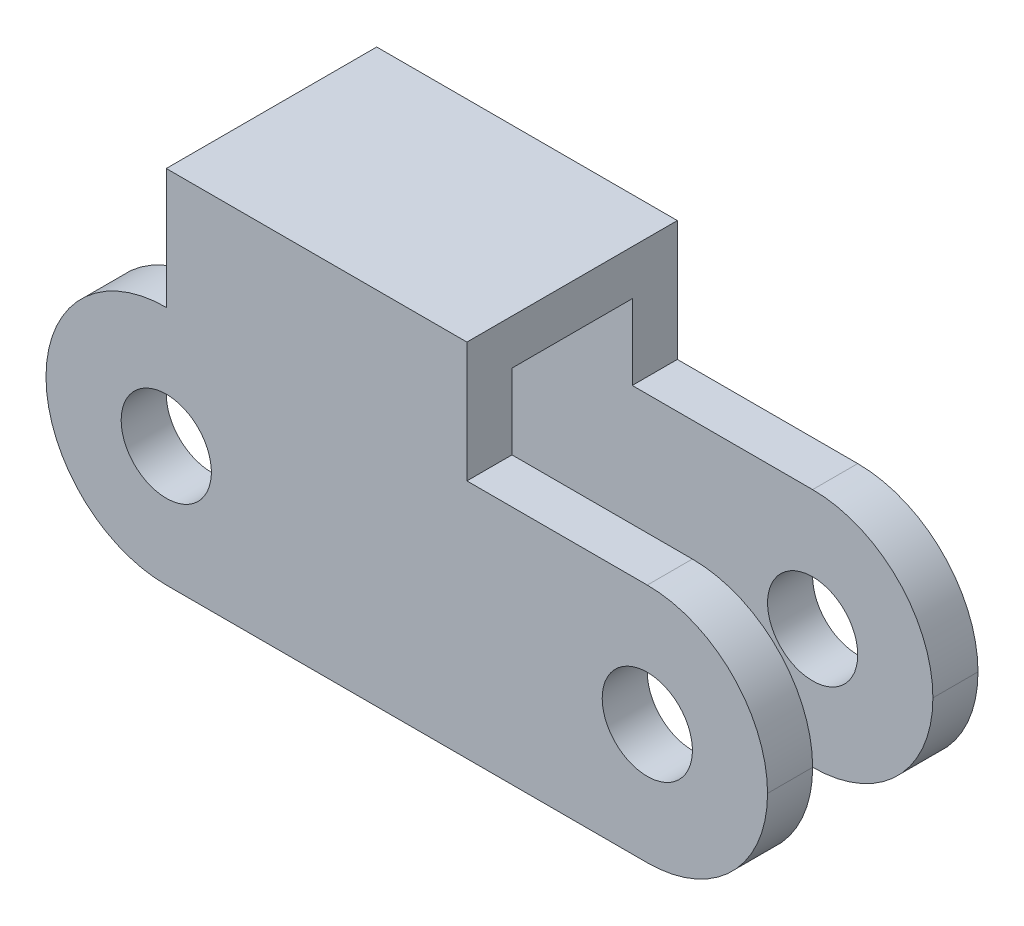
ISO-10303-21;
HEADER;
FILE_DESCRIPTION(('STEP AP214'),'2;1');
FILE_NAME('part.step','',(''),(''),'','','');
FILE_SCHEMA(('AUTOMOTIVE_DESIGN { 1 0 10303 214 1 1 1 1 }'));
ENDSEC;
DATA;
#1=APPLICATION_CONTEXT('core data for automotive mechanical design processes');
#2=APPLICATION_PROTOCOL_DEFINITION('international standard','automotive_design',2000,#1);
#3=PRODUCT_CONTEXT('',#1,'mechanical');
#4=PRODUCT('Part','Part','',(#3));
#5=PRODUCT_RELATED_PRODUCT_CATEGORY('part','',(#4));
#6=PRODUCT_DEFINITION_FORMATION('','',#4);
#7=PRODUCT_DEFINITION_CONTEXT('part definition',#1,'design');
#8=PRODUCT_DEFINITION('design','',#6,#7);
#9=PRODUCT_DEFINITION_SHAPE('','',#8);
#10=(LENGTH_UNIT() NAMED_UNIT(*) SI_UNIT(.MILLI.,.METRE.));
#11=(NAMED_UNIT(*) PLANE_ANGLE_UNIT() SI_UNIT($,.RADIAN.));
#12=(NAMED_UNIT(*) SI_UNIT($,.STERADIAN.) SOLID_ANGLE_UNIT());
#13=UNCERTAINTY_MEASURE_WITH_UNIT(LENGTH_MEASURE(1.E-05),#10,'distance_accuracy_value','');
#14=(GEOMETRIC_REPRESENTATION_CONTEXT(3) GLOBAL_UNCERTAINTY_ASSIGNED_CONTEXT((#13)) GLOBAL_UNIT_ASSIGNED_CONTEXT((#10,
#11,#12)) REPRESENTATION_CONTEXT('',''));
#15=CARTESIAN_POINT('',(0.,0.,0.));
#16=DIRECTION('',(0.,0.,1.));
#17=DIRECTION('',(1.,0.,0.));
#18=AXIS2_PLACEMENT_3D('',#15,#16,#17);
#19=CARTESIAN_POINT('',(0.,0.,0.));
#20=DIRECTION('',(0.,0.,-1.));
#21=DIRECTION('',(-1.,0.,0.));
#22=AXIS2_PLACEMENT_3D('',#19,#20,#21);
#23=PLANE('',#22);
#24=CARTESIAN_POINT('',(-22.7894430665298,4.49999999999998,0.));
#25=DIRECTION('',(0.,0.,-1.));
#26=DIRECTION('',(-1.,0.,0.));
#27=AXIS2_PLACEMENT_3D('',#24,#25,#26);
#28=CIRCLE('',#27,3.);
#29=CARTESIAN_POINT('',(-25.7894430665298,4.49999999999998,0.));
#30=VERTEX_POINT('',#29);
#31=EDGE_CURVE('E354',#30,#30,#28,.T.);
#32=ORIENTED_EDGE('',*,*,#31,.F.);
#33=EDGE_LOOP('',(#32));
#34=FACE_BOUND('',#33,.T.);
#35=CARTESIAN_POINT('',(9.21055693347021,4.4778667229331,0.));
#36=DIRECTION('',(0.,0.,-1.));
#37=DIRECTION('',(-1.,0.,0.));
#38=AXIS2_PLACEMENT_3D('',#35,#36,#37);
#39=CIRCLE('',#38,3.);
#40=CARTESIAN_POINT('',(6.2105569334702,4.4778667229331,0.));
#41=VERTEX_POINT('',#40);
#42=EDGE_CURVE('E316',#41,#41,#39,.T.);
#43=ORIENTED_EDGE('',*,*,#42,.F.);
#44=EDGE_LOOP('',(#43));
#45=FACE_BOUND('',#44,.T.);
#46=DIRECTION('',(1.,0.,0.));
#47=VECTOR('',#46,1.);
#48=CARTESIAN_POINT('',(17.2105263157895,-3.50000000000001,0.));
#49=LINE('',#48,#47);
#50=CARTESIAN_POINT('',(-22.7894736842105,-3.50000000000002,0.));
#51=VERTEX_POINT('',#50);
#52=CARTESIAN_POINT('',(9.21052631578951,-3.50000000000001,0.));
#53=VERTEX_POINT('',#52);
#54=EDGE_CURVE('E202',#51,#53,#49,.T.);
#55=ORIENTED_EDGE('',*,*,#54,.F.);
#56=CARTESIAN_POINT('',(-22.7894736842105,4.49999999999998,0.));
#57=DIRECTION('',(0.,0.,-1.));
#58=DIRECTION('',(-1.,0.,0.));
#59=AXIS2_PLACEMENT_3D('',#56,#57,#58);
#60=CIRCLE('',#59,8.);
#61=CARTESIAN_POINT('',(-30.7894736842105,4.49999999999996,0.));
#62=VERTEX_POINT('',#61);
#63=EDGE_CURVE('E256',#51,#62,#60,.T.);
#64=ORIENTED_EDGE('',*,*,#63,.T.);
#65=CARTESIAN_POINT('',(-22.7894736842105,4.49999999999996,0.));
#66=DIRECTION('',(0.,0.,-1.));
#67=DIRECTION('',(-1.,0.,0.));
#68=AXIS2_PLACEMENT_3D('',#65,#66,#67);
#69=CIRCLE('',#68,8.);
#70=CARTESIAN_POINT('',(-22.7894736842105,12.5,0.));
#71=VERTEX_POINT('',#70);
#72=EDGE_CURVE('E254',#62,#71,#69,.T.);
#73=ORIENTED_EDGE('',*,*,#72,.T.);
#74=DIRECTION('',(0.,-1.,0.));
#75=VECTOR('',#74,1.);
#76=CARTESIAN_POINT('',(-22.7894736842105,12.5,0.));
#77=LINE('',#76,#75);
#78=CARTESIAN_POINT('',(-22.7894736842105,17.5,0.));
#79=VERTEX_POINT('',#78);
#80=EDGE_CURVE('E207',#79,#71,#77,.T.);
#81=ORIENTED_EDGE('',*,*,#80,.F.);
#82=DIRECTION('',(1.,0.,0.));
#83=VECTOR('',#82,1.);
#84=CARTESIAN_POINT('',(0.,17.5,0.));
#85=LINE('',#84,#83);
#86=CARTESIAN_POINT('',(-2.7894736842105,17.5,0.));
#87=VERTEX_POINT('',#86);
#88=EDGE_CURVE('E167',#79,#87,#85,.T.);
#89=ORIENTED_EDGE('',*,*,#88,.T.);
#90=DIRECTION('',(0.,1.,0.));
#91=VECTOR('',#90,1.);
#92=CARTESIAN_POINT('',(-2.7894736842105,20.5,0.));
#93=LINE('',#92,#91);
#94=CARTESIAN_POINT('',(-2.7894736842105,12.5,0.));
#95=VERTEX_POINT('',#94);
#96=EDGE_CURVE('E220',#95,#87,#93,.T.);
#97=ORIENTED_EDGE('',*,*,#96,.F.);
#98=DIRECTION('',(-1.,0.,0.));
#99=VECTOR('',#98,1.);
#100=CARTESIAN_POINT('',(-2.7894736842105,12.5,0.));
#101=LINE('',#100,#99);
#102=CARTESIAN_POINT('',(9.21052631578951,12.5,0.));
#103=VERTEX_POINT('',#102);
#104=EDGE_CURVE('E218',#103,#95,#101,.T.);
#105=ORIENTED_EDGE('',*,*,#104,.F.);
#106=CARTESIAN_POINT('',(9.21052631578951,4.49999999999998,0.));
#107=DIRECTION('',(0.,0.,-1.));
#108=DIRECTION('',(-1.,0.,0.));
#109=AXIS2_PLACEMENT_3D('',#106,#107,#108);
#110=CIRCLE('',#109,8.);
#111=CARTESIAN_POINT('',(17.2105263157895,4.49999999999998,0.));
#112=VERTEX_POINT('',#111);
#113=EDGE_CURVE('E250',#103,#112,#110,.T.);
#114=ORIENTED_EDGE('',*,*,#113,.T.);
#115=CARTESIAN_POINT('',(9.21052631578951,4.49999999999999,0.));
#116=DIRECTION('',(0.,0.,-1.));
#117=DIRECTION('',(-1.,0.,0.));
#118=AXIS2_PLACEMENT_3D('',#115,#116,#117);
#119=CIRCLE('',#118,8.);
#120=EDGE_CURVE('E252',#112,#53,#119,.T.);
#121=ORIENTED_EDGE('',*,*,#120,.T.);
#122=EDGE_LOOP('',(#55,#64,#73,#81,#89,#97,#105,#114,#121));
#123=FACE_BOUND('',#122,.T.);
#124=ADVANCED_FACE('F35',(#34,#45,#123),#23,.T.);
#125=CARTESIAN_POINT('',(17.2105263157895,-3.50000000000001,3.));
#126=DIRECTION('',(0.,1.,0.));
#127=DIRECTION('',(-1.,0.,0.));
#128=AXIS2_PLACEMENT_3D('',#125,#126,#127);
#129=PLANE('',#128);
#130=DIRECTION('',(1.,0.,0.));
#131=VECTOR('',#130,1.);
#132=CARTESIAN_POINT('',(17.2105263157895,-3.50000000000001,3.));
#133=LINE('',#132,#131);
#134=CARTESIAN_POINT('',(-22.7894736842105,-3.50000000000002,3.));
#135=VERTEX_POINT('',#134);
#136=CARTESIAN_POINT('',(9.21052631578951,-3.50000000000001,3.));
#137=VERTEX_POINT('',#136);
#138=EDGE_CURVE('E203',#135,#137,#133,.T.);
#139=ORIENTED_EDGE('',*,*,#138,.F.);
#140=DIRECTION('',(0.,0.,-1.));
#141=VECTOR('',#140,1.);
#142=CARTESIAN_POINT('',(-22.7894736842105,-3.50000000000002,3.));
#143=LINE('',#142,#141);
#144=EDGE_CURVE('E247',#135,#51,#143,.T.);
#145=ORIENTED_EDGE('',*,*,#144,.T.);
#146=ORIENTED_EDGE('',*,*,#54,.T.);
#147=DIRECTION('',(0.,0.,-1.));
#148=VECTOR('',#147,1.);
#149=CARTESIAN_POINT('',(9.21052631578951,-3.50000000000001,3.));
#150=LINE('',#149,#148);
#151=EDGE_CURVE('E234',#53,#137,#150,.F.);
#152=ORIENTED_EDGE('',*,*,#151,.T.);
#153=EDGE_LOOP('',(#139,#145,#146,#152));
#154=FACE_BOUND('',#153,.T.);
#155=ADVANCED_FACE('F379',(#154),#129,.F.);
#156=CARTESIAN_POINT('',(-2.7894736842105,12.5,3.));
#157=DIRECTION('',(0.,-1.,0.));
#158=DIRECTION('',(0.,0.,-1.));
#159=AXIS2_PLACEMENT_3D('',#156,#157,#158);
#160=PLANE('',#159);
#161=DIRECTION('',(-1.,0.,0.));
#162=VECTOR('',#161,1.);
#163=CARTESIAN_POINT('',(-2.7894736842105,12.5,3.));
#164=LINE('',#163,#162);
#165=CARTESIAN_POINT('',(9.21052631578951,12.5,3.));
#166=VERTEX_POINT('',#165);
#167=CARTESIAN_POINT('',(-2.7894736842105,12.5,3.));
#168=VERTEX_POINT('',#167);
#169=EDGE_CURVE('E206',#166,#168,#164,.T.);
#170=ORIENTED_EDGE('',*,*,#169,.F.);
#171=DIRECTION('',(0.,0.,-1.));
#172=VECTOR('',#171,1.);
#173=CARTESIAN_POINT('',(9.21052631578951,12.5,3.));
#174=LINE('',#173,#172);
#175=EDGE_CURVE('E266',#166,#103,#174,.T.);
#176=ORIENTED_EDGE('',*,*,#175,.T.);
#177=ORIENTED_EDGE('',*,*,#104,.T.);
#178=DIRECTION('',(0.,0.,-1.));
#179=VECTOR('',#178,1.);
#180=CARTESIAN_POINT('',(-2.7894736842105,12.5,3.));
#181=LINE('',#180,#179);
#182=EDGE_CURVE('E230',#168,#95,#181,.T.);
#183=ORIENTED_EDGE('',*,*,#182,.F.);
#184=EDGE_LOOP('',(#170,#176,#177,#183));
#185=FACE_BOUND('',#184,.T.);
#186=ADVANCED_FACE('F385',(#185),#160,.F.);
#187=CARTESIAN_POINT('',(-2.7894736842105,20.5,3.));
#188=DIRECTION('',(-1.,0.,0.));
#189=DIRECTION('',(0.,-1.,0.));
#190=AXIS2_PLACEMENT_3D('',#187,#188,#189);
#191=PLANE('',#190);
#192=DIRECTION('',(0.,0.,-1.));
#193=VECTOR('',#192,1.);
#194=CARTESIAN_POINT('',(-2.7894736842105,20.5,3.));
#195=LINE('',#194,#193);
#196=CARTESIAN_POINT('',(-2.7894736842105,20.5,3.));
#197=VERTEX_POINT('',#196);
#198=CARTESIAN_POINT('',(-2.7894736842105,20.5,-11.));
#199=VERTEX_POINT('',#198);
#200=EDGE_CURVE('E228',#197,#199,#195,.T.);
#201=ORIENTED_EDGE('',*,*,#200,.F.);
#202=DIRECTION('',(0.,1.,0.));
#203=VECTOR('',#202,1.);
#204=CARTESIAN_POINT('',(-2.7894736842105,20.5,3.));
#205=LINE('',#204,#203);
#206=EDGE_CURVE('E209',#168,#197,#205,.T.);
#207=ORIENTED_EDGE('',*,*,#206,.F.);
#208=ORIENTED_EDGE('',*,*,#182,.T.);
#209=ORIENTED_EDGE('',*,*,#96,.T.);
#210=DIRECTION('',(0.,0.,-1.));
#211=VECTOR('',#210,1.);
#212=CARTESIAN_POINT('',(-2.7894736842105,17.5,0.));
#213=LINE('',#212,#211);
#214=CARTESIAN_POINT('',(-2.7894736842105,17.5,-8.));
#215=VERTEX_POINT('',#214);
#216=EDGE_CURVE('E172',#87,#215,#213,.T.);
#217=ORIENTED_EDGE('',*,*,#216,.T.);
#218=DIRECTION('',(0.,1.,0.));
#219=VECTOR('',#218,1.);
#220=CARTESIAN_POINT('',(-2.7894736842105,20.5,-8.));
#221=LINE('',#220,#219);
#222=CARTESIAN_POINT('',(-2.7894736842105,12.5,-8.));
#223=VERTEX_POINT('',#222);
#224=EDGE_CURVE('E181',#223,#215,#221,.T.);
#225=ORIENTED_EDGE('',*,*,#224,.F.);
#226=DIRECTION('',(0.,0.,1.));
#227=VECTOR('',#226,1.);
#228=CARTESIAN_POINT('',(-2.7894736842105,12.5,-11.));
#229=LINE('',#228,#227);
#230=CARTESIAN_POINT('',(-2.7894736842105,12.5,-11.));
#231=VERTEX_POINT('',#230);
#232=EDGE_CURVE('E182',#231,#223,#229,.T.);
#233=ORIENTED_EDGE('',*,*,#232,.F.);
#234=DIRECTION('',(0.,1.,0.));
#235=VECTOR('',#234,1.);
#236=CARTESIAN_POINT('',(-2.7894736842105,20.5,-11.));
#237=LINE('',#236,#235);
#238=EDGE_CURVE('E311',#231,#199,#237,.T.);
#239=ORIENTED_EDGE('',*,*,#238,.T.);
#240=EDGE_LOOP('',(#201,#207,#208,#209,#217,#225,#233,#239));
#241=FACE_BOUND('',#240,.T.);
#242=ADVANCED_FACE('F327',(#241),#191,.F.);
#243=CARTESIAN_POINT('',(-22.7894736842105,20.5,3.));
#244=DIRECTION('',(0.,-1.,0.));
#245=DIRECTION('',(1.,0.,0.));
#246=AXIS2_PLACEMENT_3D('',#243,#244,#245);
#247=PLANE('',#246);
#248=ORIENTED_EDGE('',*,*,#200,.T.);
#249=DIRECTION('',(-1.,0.,0.));
#250=VECTOR('',#249,1.);
#251=CARTESIAN_POINT('',(-22.7894736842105,20.5,-11.));
#252=LINE('',#251,#250);
#253=CARTESIAN_POINT('',(-22.7894736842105,20.5,-11.));
#254=VERTEX_POINT('',#253);
#255=EDGE_CURVE('E309',#199,#254,#252,.T.);
#256=ORIENTED_EDGE('',*,*,#255,.T.);
#257=DIRECTION('',(0.,0.,-1.));
#258=VECTOR('',#257,1.);
#259=CARTESIAN_POINT('',(-22.7894736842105,20.5,3.));
#260=LINE('',#259,#258);
#261=CARTESIAN_POINT('',(-22.7894736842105,20.5,3.));
#262=VERTEX_POINT('',#261);
#263=EDGE_CURVE('E226',#262,#254,#260,.T.);
#264=ORIENTED_EDGE('',*,*,#263,.F.);
#265=DIRECTION('',(-1.,0.,0.));
#266=VECTOR('',#265,1.);
#267=CARTESIAN_POINT('',(-22.7894736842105,20.5,3.));
#268=LINE('',#267,#266);
#269=EDGE_CURVE('E211',#197,#262,#268,.T.);
#270=ORIENTED_EDGE('',*,*,#269,.F.);
#271=EDGE_LOOP('',(#248,#256,#264,#270));
#272=FACE_BOUND('',#271,.T.);
#273=ADVANCED_FACE('F345',(#272),#247,.F.);
#274=CARTESIAN_POINT('',(-22.7894736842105,12.5,3.));
#275=DIRECTION('',(1.,0.,0.));
#276=DIRECTION('',(0.,1.,0.));
#277=AXIS2_PLACEMENT_3D('',#274,#275,#276);
#278=PLANE('',#277);
#279=ORIENTED_EDGE('',*,*,#263,.T.);
#280=DIRECTION('',(0.,-1.,0.));
#281=VECTOR('',#280,1.);
#282=CARTESIAN_POINT('',(-22.7894736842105,12.5,-11.));
#283=LINE('',#282,#281);
#284=CARTESIAN_POINT('',(-22.7894736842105,12.5,-11.));
#285=VERTEX_POINT('',#284);
#286=EDGE_CURVE('E198',#254,#285,#283,.T.);
#287=ORIENTED_EDGE('',*,*,#286,.T.);
#288=DIRECTION('',(0.,0.,1.));
#289=VECTOR('',#288,1.);
#290=CARTESIAN_POINT('',(-22.7894736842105,12.5,-11.));
#291=LINE('',#290,#289);
#292=CARTESIAN_POINT('',(-22.7894736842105,12.5,-7.99999999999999));
#293=VERTEX_POINT('',#292);
#294=EDGE_CURVE('E187',#285,#293,#291,.T.);
#295=ORIENTED_EDGE('',*,*,#294,.T.);
#296=DIRECTION('',(0.,-1.,0.));
#297=VECTOR('',#296,1.);
#298=CARTESIAN_POINT('',(-22.7894736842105,12.5,-7.99999999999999));
#299=LINE('',#298,#297);
#300=CARTESIAN_POINT('',(-22.7894736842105,17.5,-7.99999999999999));
#301=VERTEX_POINT('',#300);
#302=EDGE_CURVE('E178',#301,#293,#299,.T.);
#303=ORIENTED_EDGE('',*,*,#302,.F.);
#304=DIRECTION('',(0.,0.,-1.));
#305=VECTOR('',#304,1.);
#306=CARTESIAN_POINT('',(-22.7894736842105,17.5,0.));
#307=LINE('',#306,#305);
#308=EDGE_CURVE('E161',#79,#301,#307,.T.);
#309=ORIENTED_EDGE('',*,*,#308,.F.);
#310=ORIENTED_EDGE('',*,*,#80,.T.);
#311=DIRECTION('',(0.,0.,-1.));
#312=VECTOR('',#311,1.);
#313=CARTESIAN_POINT('',(-22.7894736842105,12.5,3.));
#314=LINE('',#313,#312);
#315=CARTESIAN_POINT('',(-22.7894736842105,12.5,3.));
#316=VERTEX_POINT('',#315);
#317=EDGE_CURVE('E215',#316,#71,#314,.T.);
#318=ORIENTED_EDGE('',*,*,#317,.F.);
#319=DIRECTION('',(0.,-1.,0.));
#320=VECTOR('',#319,1.);
#321=CARTESIAN_POINT('',(-22.7894736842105,12.5,3.));
#322=LINE('',#321,#320);
#323=EDGE_CURVE('E213',#262,#316,#322,.T.);
#324=ORIENTED_EDGE('',*,*,#323,.F.);
#325=EDGE_LOOP('',(#279,#287,#295,#303,#309,#310,#318,#324));
#326=FACE_BOUND('',#325,.T.);
#327=ADVANCED_FACE('F184',(#326),#278,.F.);
#328=CARTESIAN_POINT('',(0.,0.,3.));
#329=DIRECTION('',(0.,0.,-1.));
#330=DIRECTION('',(-1.,0.,0.));
#331=AXIS2_PLACEMENT_3D('',#328,#329,#330);
#332=PLANE('',#331);
#333=CARTESIAN_POINT('',(-22.7894430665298,4.49999999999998,3.00000000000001));
#334=DIRECTION('',(0.,0.,-1.));
#335=DIRECTION('',(-1.,0.,0.));
#336=AXIS2_PLACEMENT_3D('',#333,#334,#335);
#337=CIRCLE('',#336,3.);
#338=CARTESIAN_POINT('',(-25.7894430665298,4.49999999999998,3.00000000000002));
#339=VERTEX_POINT('',#338);
#340=EDGE_CURVE('E244',#339,#339,#337,.T.);
#341=ORIENTED_EDGE('',*,*,#340,.T.);
#342=EDGE_LOOP('',(#341));
#343=FACE_BOUND('',#342,.T.);
#344=CARTESIAN_POINT('',(9.21055693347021,4.4778667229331,3.));
#345=DIRECTION('',(0.,0.,-1.));
#346=DIRECTION('',(-1.,0.,0.));
#347=AXIS2_PLACEMENT_3D('',#344,#345,#346);
#348=CIRCLE('',#347,3.);
#349=CARTESIAN_POINT('',(6.21055693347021,4.4778667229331,3.));
#350=VERTEX_POINT('',#349);
#351=EDGE_CURVE('E239',#350,#350,#348,.T.);
#352=ORIENTED_EDGE('',*,*,#351,.T.);
#353=EDGE_LOOP('',(#352));
#354=FACE_BOUND('',#353,.T.);
#355=CARTESIAN_POINT('',(-22.7894736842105,4.49999999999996,3.));
#356=DIRECTION('',(0.,0.,-1.));
#357=DIRECTION('',(-1.,0.,0.));
#358=AXIS2_PLACEMENT_3D('',#355,#356,#357);
#359=CIRCLE('',#358,8.);
#360=CARTESIAN_POINT('',(-30.7894736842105,4.49999999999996,3.));
#361=VERTEX_POINT('',#360);
#362=EDGE_CURVE('E262',#316,#361,#359,.F.);
#363=ORIENTED_EDGE('',*,*,#362,.T.);
#364=CARTESIAN_POINT('',(-22.7894736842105,4.49999999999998,3.));
#365=DIRECTION('',(0.,0.,-1.));
#366=DIRECTION('',(-1.,0.,0.));
#367=AXIS2_PLACEMENT_3D('',#364,#365,#366);
#368=CIRCLE('',#367,8.);
#369=EDGE_CURVE('E264',#361,#135,#368,.F.);
#370=ORIENTED_EDGE('',*,*,#369,.T.);
#371=ORIENTED_EDGE('',*,*,#138,.T.);
#372=CARTESIAN_POINT('',(9.21052631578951,4.49999999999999,3.));
#373=DIRECTION('',(0.,0.,-1.));
#374=DIRECTION('',(-1.,0.,0.));
#375=AXIS2_PLACEMENT_3D('',#372,#373,#374);
#376=CIRCLE('',#375,8.);
#377=CARTESIAN_POINT('',(17.2105263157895,4.49999999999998,3.));
#378=VERTEX_POINT('',#377);
#379=EDGE_CURVE('E260',#137,#378,#376,.F.);
#380=ORIENTED_EDGE('',*,*,#379,.T.);
#381=CARTESIAN_POINT('',(9.21052631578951,4.49999999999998,3.));
#382=DIRECTION('',(0.,0.,-1.));
#383=DIRECTION('',(-1.,0.,0.));
#384=AXIS2_PLACEMENT_3D('',#381,#382,#383);
#385=CIRCLE('',#384,8.);
#386=EDGE_CURVE('E258',#378,#166,#385,.F.);
#387=ORIENTED_EDGE('',*,*,#386,.T.);
#388=ORIENTED_EDGE('',*,*,#169,.T.);
#389=ORIENTED_EDGE('',*,*,#206,.T.);
#390=ORIENTED_EDGE('',*,*,#269,.T.);
#391=ORIENTED_EDGE('',*,*,#323,.T.);
#392=EDGE_LOOP('',(#363,#370,#371,#380,#387,#388,#389,#390,#391));
#393=FACE_BOUND('',#392,.T.);
#394=ADVANCED_FACE('F340',(#343,#354,#393),#332,.F.);
#395=CARTESIAN_POINT('',(0.,17.5,0.));
#396=DIRECTION('',(0.,1.,0.));
#397=DIRECTION('',(0.,0.,1.));
#398=AXIS2_PLACEMENT_3D('',#395,#396,#397);
#399=PLANE('',#398);
#400=ORIENTED_EDGE('',*,*,#88,.F.);
#401=ORIENTED_EDGE('',*,*,#308,.T.);
#402=DIRECTION('',(1.,0.,0.));
#403=VECTOR('',#402,1.);
#404=CARTESIAN_POINT('',(0.,17.5,-8.));
#405=LINE('',#404,#403);
#406=EDGE_CURVE('E164',#301,#215,#405,.T.);
#407=ORIENTED_EDGE('',*,*,#406,.T.);
#408=ORIENTED_EDGE('',*,*,#216,.F.);
#409=EDGE_LOOP('',(#400,#401,#407,#408));
#410=FACE_BOUND('',#409,.T.);
#411=ADVANCED_FACE('F163',(#410),#399,.F.);
#412=CARTESIAN_POINT('',(0.,0.,-8.));
#413=DIRECTION('',(0.,0.,1.));
#414=DIRECTION('',(-1.,0.,0.));
#415=AXIS2_PLACEMENT_3D('',#412,#413,#414);
#416=PLANE('',#415);
#417=CARTESIAN_POINT('',(-22.7894430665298,4.49999999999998,-7.99999999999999));
#418=DIRECTION('',(0.,0.,1.));
#419=DIRECTION('',(1.,0.,0.));
#420=AXIS2_PLACEMENT_3D('',#417,#418,#419);
#421=CIRCLE('',#420,3.);
#422=CARTESIAN_POINT('',(-19.7894430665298,4.49999999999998,-7.99999999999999));
#423=VERTEX_POINT('',#422);
#424=EDGE_CURVE('E243',#423,#423,#421,.T.);
#425=ORIENTED_EDGE('',*,*,#424,.F.);
#426=EDGE_LOOP('',(#425));
#427=FACE_BOUND('',#426,.T.);
#428=CARTESIAN_POINT('',(9.2105569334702,4.4778667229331,-8.));
#429=DIRECTION('',(0.,0.,1.));
#430=DIRECTION('',(1.,0.,0.));
#431=AXIS2_PLACEMENT_3D('',#428,#429,#430);
#432=CIRCLE('',#431,3.);
#433=CARTESIAN_POINT('',(12.2105569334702,4.4778667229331,-8.00000000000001));
#434=VERTEX_POINT('',#433);
#435=EDGE_CURVE('E238',#434,#434,#432,.T.);
#436=ORIENTED_EDGE('',*,*,#435,.F.);
#437=EDGE_LOOP('',(#436));
#438=FACE_BOUND('',#437,.T.);
#439=DIRECTION('',(1.,0.,0.));
#440=VECTOR('',#439,1.);
#441=CARTESIAN_POINT('',(17.2105263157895,-3.50000000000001,-8.00000000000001));
#442=LINE('',#441,#440);
#443=CARTESIAN_POINT('',(-22.7894736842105,-3.50000000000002,-7.99999999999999));
#444=VERTEX_POINT('',#443);
#445=CARTESIAN_POINT('',(9.21052631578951,-3.50000000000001,-8.));
#446=VERTEX_POINT('',#445);
#447=EDGE_CURVE('E315',#444,#446,#442,.T.);
#448=ORIENTED_EDGE('',*,*,#447,.T.);
#449=CARTESIAN_POINT('',(9.21052631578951,4.49999999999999,-8.));
#450=DIRECTION('',(0.,0.,1.));
#451=DIRECTION('',(1.,0.,0.));
#452=AXIS2_PLACEMENT_3D('',#449,#450,#451);
#453=CIRCLE('',#452,8.);
#454=CARTESIAN_POINT('',(17.2105263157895,4.49999999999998,-8.00000000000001));
#455=VERTEX_POINT('',#454);
#456=EDGE_CURVE('E280',#446,#455,#453,.T.);
#457=ORIENTED_EDGE('',*,*,#456,.T.);
#458=CARTESIAN_POINT('',(9.21052631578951,4.49999999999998,-8.));
#459=DIRECTION('',(0.,0.,1.));
#460=DIRECTION('',(1.,0.,0.));
#461=AXIS2_PLACEMENT_3D('',#458,#459,#460);
#462=CIRCLE('',#461,8.);
#463=CARTESIAN_POINT('',(9.21052631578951,12.5,-8.));
#464=VERTEX_POINT('',#463);
#465=EDGE_CURVE('E278',#455,#464,#462,.T.);
#466=ORIENTED_EDGE('',*,*,#465,.T.);
#467=DIRECTION('',(-1.,0.,0.));
#468=VECTOR('',#467,1.);
#469=CARTESIAN_POINT('',(-2.7894736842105,12.5,-8.));
#470=LINE('',#469,#468);
#471=EDGE_CURVE('E193',#464,#223,#470,.T.);
#472=ORIENTED_EDGE('',*,*,#471,.T.);
#473=ORIENTED_EDGE('',*,*,#224,.T.);
#474=ORIENTED_EDGE('',*,*,#406,.F.);
#475=ORIENTED_EDGE('',*,*,#302,.T.);
#476=CARTESIAN_POINT('',(-22.7894736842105,4.49999999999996,-7.99999999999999));
#477=DIRECTION('',(0.,0.,1.));
#478=DIRECTION('',(1.,0.,0.));
#479=AXIS2_PLACEMENT_3D('',#476,#477,#478);
#480=CIRCLE('',#479,8.);
#481=CARTESIAN_POINT('',(-30.7894736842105,4.49999999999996,-7.99999999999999));
#482=VERTEX_POINT('',#481);
#483=EDGE_CURVE('E274',#293,#482,#480,.T.);
#484=ORIENTED_EDGE('',*,*,#483,.T.);
#485=CARTESIAN_POINT('',(-22.7894736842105,4.49999999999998,-7.99999999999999));
#486=DIRECTION('',(0.,0.,1.));
#487=DIRECTION('',(1.,0.,0.));
#488=AXIS2_PLACEMENT_3D('',#485,#486,#487);
#489=CIRCLE('',#488,8.);
#490=EDGE_CURVE('E276',#482,#444,#489,.T.);
#491=ORIENTED_EDGE('',*,*,#490,.T.);
#492=EDGE_LOOP('',(#448,#457,#466,#472,#473,#474,#475,#484,#491));
#493=FACE_BOUND('',#492,.T.);
#494=ADVANCED_FACE('F177',(#427,#438,#493),#416,.T.);
#495=CARTESIAN_POINT('',(17.2105263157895,-3.50000000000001,-11.));
#496=DIRECTION('',(0.,1.,0.));
#497=DIRECTION('',(-1.,0.,0.));
#498=AXIS2_PLACEMENT_3D('',#495,#496,#497);
#499=PLANE('',#498);
#500=DIRECTION('',(1.,0.,0.));
#501=VECTOR('',#500,1.);
#502=CARTESIAN_POINT('',(17.2105263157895,-3.50000000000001,-11.));
#503=LINE('',#502,#501);
#504=CARTESIAN_POINT('',(-22.7894736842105,-3.50000000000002,-11.));
#505=VERTEX_POINT('',#504);
#506=CARTESIAN_POINT('',(9.21052631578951,-3.50000000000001,-11.));
#507=VERTEX_POINT('',#506);
#508=EDGE_CURVE('E188',#505,#507,#503,.T.);
#509=ORIENTED_EDGE('',*,*,#508,.T.);
#510=DIRECTION('',(0.,0.,1.));
#511=VECTOR('',#510,1.);
#512=CARTESIAN_POINT('',(9.21052631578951,-3.50000000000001,-11.));
#513=LINE('',#512,#511);
#514=EDGE_CURVE('E271',#507,#446,#513,.T.);
#515=ORIENTED_EDGE('',*,*,#514,.T.);
#516=ORIENTED_EDGE('',*,*,#447,.F.);
#517=DIRECTION('',(0.,0.,1.));
#518=VECTOR('',#517,1.);
#519=CARTESIAN_POINT('',(-22.7894736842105,-3.50000000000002,-11.));
#520=LINE('',#519,#518);
#521=EDGE_CURVE('E268',#444,#505,#520,.F.);
#522=ORIENTED_EDGE('',*,*,#521,.T.);
#523=EDGE_LOOP('',(#509,#515,#516,#522));
#524=FACE_BOUND('',#523,.T.);
#525=ADVANCED_FACE('F471',(#524),#499,.F.);
#526=CARTESIAN_POINT('',(-2.7894736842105,12.5,-11.));
#527=DIRECTION('',(0.,-1.,0.));
#528=DIRECTION('',(0.,0.,1.));
#529=AXIS2_PLACEMENT_3D('',#526,#527,#528);
#530=PLANE('',#529);
#531=ORIENTED_EDGE('',*,*,#471,.F.);
#532=DIRECTION('',(0.,0.,1.));
#533=VECTOR('',#532,1.);
#534=CARTESIAN_POINT('',(9.21052631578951,12.5,-11.));
#535=LINE('',#534,#533);
#536=CARTESIAN_POINT('',(9.21052631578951,12.5,-11.));
#537=VERTEX_POINT('',#536);
#538=EDGE_CURVE('E11',#464,#537,#535,.F.);
#539=ORIENTED_EDGE('',*,*,#538,.T.);
#540=DIRECTION('',(-1.,0.,0.));
#541=VECTOR('',#540,1.);
#542=CARTESIAN_POINT('',(-2.7894736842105,12.5,-11.));
#543=LINE('',#542,#541);
#544=EDGE_CURVE('E191',#537,#231,#543,.T.);
#545=ORIENTED_EDGE('',*,*,#544,.T.);
#546=ORIENTED_EDGE('',*,*,#232,.T.);
#547=EDGE_LOOP('',(#531,#539,#545,#546));
#548=FACE_BOUND('',#547,.T.);
#549=ADVANCED_FACE('F322',(#548),#530,.F.);
#550=CARTESIAN_POINT('',(0.,0.,-11.));
#551=DIRECTION('',(0.,0.,1.));
#552=DIRECTION('',(-1.,0.,0.));
#553=AXIS2_PLACEMENT_3D('',#550,#551,#552);
#554=PLANE('',#553);
#555=CARTESIAN_POINT('',(-22.7894430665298,4.49999999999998,-11.));
#556=DIRECTION('',(0.,0.,1.));
#557=DIRECTION('',(1.,0.,0.));
#558=AXIS2_PLACEMENT_3D('',#555,#556,#557);
#559=CIRCLE('',#558,3.);
#560=CARTESIAN_POINT('',(-19.7894430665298,4.49999999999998,-11.));
#561=VERTEX_POINT('',#560);
#562=EDGE_CURVE('E240',#561,#561,#559,.T.);
#563=ORIENTED_EDGE('',*,*,#562,.T.);
#564=EDGE_LOOP('',(#563));
#565=FACE_BOUND('',#564,.T.);
#566=CARTESIAN_POINT('',(9.2105569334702,4.4778667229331,-11.));
#567=DIRECTION('',(0.,0.,1.));
#568=DIRECTION('',(1.,0.,0.));
#569=AXIS2_PLACEMENT_3D('',#566,#567,#568);
#570=CIRCLE('',#569,3.);
#571=CARTESIAN_POINT('',(12.2105569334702,4.4778667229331,-11.));
#572=VERTEX_POINT('',#571);
#573=EDGE_CURVE('E235',#572,#572,#570,.T.);
#574=ORIENTED_EDGE('',*,*,#573,.T.);
#575=EDGE_LOOP('',(#574));
#576=FACE_BOUND('',#575,.T.);
#577=CARTESIAN_POINT('',(9.21052631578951,4.49999999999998,-11.));
#578=DIRECTION('',(0.,0.,1.));
#579=DIRECTION('',(1.,0.,0.));
#580=AXIS2_PLACEMENT_3D('',#577,#578,#579);
#581=CIRCLE('',#580,8.);
#582=CARTESIAN_POINT('',(17.2105263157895,4.49999999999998,-11.));
#583=VERTEX_POINT('',#582);
#584=EDGE_CURVE('E59',#537,#583,#581,.F.);
#585=ORIENTED_EDGE('',*,*,#584,.T.);
#586=CARTESIAN_POINT('',(9.21052631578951,4.49999999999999,-11.));
#587=DIRECTION('',(0.,0.,1.));
#588=DIRECTION('',(1.,0.,0.));
#589=AXIS2_PLACEMENT_3D('',#586,#587,#588);
#590=CIRCLE('',#589,8.);
#591=EDGE_CURVE('E44',#583,#507,#590,.F.);
#592=ORIENTED_EDGE('',*,*,#591,.T.);
#593=ORIENTED_EDGE('',*,*,#508,.F.);
#594=CARTESIAN_POINT('',(-22.7894736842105,4.49999999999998,-11.));
#595=DIRECTION('',(0.,0.,1.));
#596=DIRECTION('',(1.,0.,0.));
#597=AXIS2_PLACEMENT_3D('',#594,#595,#596);
#598=CIRCLE('',#597,8.);
#599=CARTESIAN_POINT('',(-30.7894736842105,4.49999999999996,-11.));
#600=VERTEX_POINT('',#599);
#601=EDGE_CURVE('E52',#505,#600,#598,.F.);
#602=ORIENTED_EDGE('',*,*,#601,.T.);
#603=CARTESIAN_POINT('',(-22.7894736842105,4.49999999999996,-11.));
#604=DIRECTION('',(0.,0.,1.));
#605=DIRECTION('',(1.,0.,0.));
#606=AXIS2_PLACEMENT_3D('',#603,#604,#605);
#607=CIRCLE('',#606,8.);
#608=EDGE_CURVE('E282',#600,#285,#607,.F.);
#609=ORIENTED_EDGE('',*,*,#608,.T.);
#610=ORIENTED_EDGE('',*,*,#286,.F.);
#611=ORIENTED_EDGE('',*,*,#255,.F.);
#612=ORIENTED_EDGE('',*,*,#238,.F.);
#613=ORIENTED_EDGE('',*,*,#544,.F.);
#614=EDGE_LOOP('',(#585,#592,#593,#602,#609,#610,#611,#612,#613));
#615=FACE_BOUND('',#614,.T.);
#616=ADVANCED_FACE('F304',(#565,#576,#615),#554,.F.);
#617=CARTESIAN_POINT('',(9.21055693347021,4.4778667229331,3.));
#618=DIRECTION('',(0.,0.,-1.));
#619=DIRECTION('',(-1.,0.,0.));
#620=AXIS2_PLACEMENT_3D('',#617,#618,#619);
#621=CYLINDRICAL_SURFACE('',#620,3.);
#622=ORIENTED_EDGE('',*,*,#435,.T.);
#623=EDGE_LOOP('',(#622));
#624=FACE_BOUND('',#623,.T.);
#625=ORIENTED_EDGE('',*,*,#573,.F.);
#626=EDGE_LOOP('',(#625));
#627=FACE_BOUND('',#626,.T.);
#628=ADVANCED_FACE('F459',(#624,#627),#621,.F.);
#629=ORIENTED_EDGE('',*,*,#42,.T.);
#630=EDGE_LOOP('',(#629));
#631=FACE_BOUND('',#630,.T.);
#632=ORIENTED_EDGE('',*,*,#351,.F.);
#633=EDGE_LOOP('',(#632));
#634=FACE_BOUND('',#633,.T.);
#635=ADVANCED_FACE('F375',(#631,#634),#621,.F.);
#636=CARTESIAN_POINT('',(-22.7894430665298,4.49999999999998,3.00000000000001));
#637=DIRECTION('',(0.,0.,-1.));
#638=DIRECTION('',(-1.,0.,0.));
#639=AXIS2_PLACEMENT_3D('',#636,#637,#638);
#640=CYLINDRICAL_SURFACE('',#639,3.);
#641=ORIENTED_EDGE('',*,*,#424,.T.);
#642=EDGE_LOOP('',(#641));
#643=FACE_BOUND('',#642,.T.);
#644=ORIENTED_EDGE('',*,*,#562,.F.);
#645=EDGE_LOOP('',(#644));
#646=FACE_BOUND('',#645,.T.);
#647=ADVANCED_FACE('F366',(#643,#646),#640,.F.);
#648=ORIENTED_EDGE('',*,*,#31,.T.);
#649=EDGE_LOOP('',(#648));
#650=FACE_BOUND('',#649,.T.);
#651=ORIENTED_EDGE('',*,*,#340,.F.);
#652=EDGE_LOOP('',(#651));
#653=FACE_BOUND('',#652,.T.);
#654=ADVANCED_FACE('F364',(#650,#653),#640,.F.);
#655=CARTESIAN_POINT('',(-22.7894736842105,4.49999999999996,3.));
#656=DIRECTION('',(0.,0.,-1.));
#657=DIRECTION('',(-1.,0.,0.));
#658=AXIS2_PLACEMENT_3D('',#655,#656,#657);
#659=CYLINDRICAL_SURFACE('',#658,8.);
#660=DIRECTION('',(0.,0.,-1.));
#661=VECTOR('',#660,1.);
#662=CARTESIAN_POINT('',(-30.7894736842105,4.49999999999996,3.));
#663=LINE('',#662,#661);
#664=EDGE_CURVE('E287',#361,#62,#663,.T.);
#665=ORIENTED_EDGE('',*,*,#664,.F.);
#666=ORIENTED_EDGE('',*,*,#362,.F.);
#667=ORIENTED_EDGE('',*,*,#317,.T.);
#668=ORIENTED_EDGE('',*,*,#72,.F.);
#669=EDGE_LOOP('',(#665,#666,#667,#668));
#670=FACE_BOUND('',#669,.T.);
#671=ADVANCED_FACE('F337',(#670),#659,.T.);
#672=CARTESIAN_POINT('',(-22.7894736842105,4.49999999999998,3.));
#673=DIRECTION('',(0.,0.,-1.));
#674=DIRECTION('',(-1.,0.,0.));
#675=AXIS2_PLACEMENT_3D('',#672,#673,#674);
#676=CYLINDRICAL_SURFACE('',#675,8.);
#677=ORIENTED_EDGE('',*,*,#369,.F.);
#678=ORIENTED_EDGE('',*,*,#664,.T.);
#679=ORIENTED_EDGE('',*,*,#63,.F.);
#680=ORIENTED_EDGE('',*,*,#144,.F.);
#681=EDGE_LOOP('',(#677,#678,#679,#680));
#682=FACE_BOUND('',#681,.T.);
#683=ADVANCED_FACE('F373',(#682),#676,.T.);
#684=CARTESIAN_POINT('',(9.21052631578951,4.49999999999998,3.));
#685=DIRECTION('',(0.,0.,-1.));
#686=DIRECTION('',(-1.,0.,0.));
#687=AXIS2_PLACEMENT_3D('',#684,#685,#686);
#688=CYLINDRICAL_SURFACE('',#687,8.);
#689=ORIENTED_EDGE('',*,*,#175,.F.);
#690=ORIENTED_EDGE('',*,*,#386,.F.);
#691=DIRECTION('',(0.,0.,-1.));
#692=VECTOR('',#691,1.);
#693=CARTESIAN_POINT('',(17.2105263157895,4.49999999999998,3.));
#694=LINE('',#693,#692);
#695=EDGE_CURVE('E290',#112,#378,#694,.F.);
#696=ORIENTED_EDGE('',*,*,#695,.F.);
#697=ORIENTED_EDGE('',*,*,#113,.F.);
#698=EDGE_LOOP('',(#689,#690,#696,#697));
#699=FACE_BOUND('',#698,.T.);
#700=ADVANCED_FACE('F403',(#699),#688,.T.);
#701=CARTESIAN_POINT('',(9.21052631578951,4.49999999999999,3.));
#702=DIRECTION('',(0.,0.,-1.));
#703=DIRECTION('',(-1.,0.,0.));
#704=AXIS2_PLACEMENT_3D('',#701,#702,#703);
#705=CYLINDRICAL_SURFACE('',#704,8.);
#706=ORIENTED_EDGE('',*,*,#379,.F.);
#707=ORIENTED_EDGE('',*,*,#151,.F.);
#708=ORIENTED_EDGE('',*,*,#120,.F.);
#709=ORIENTED_EDGE('',*,*,#695,.T.);
#710=EDGE_LOOP('',(#706,#707,#708,#709));
#711=FACE_BOUND('',#710,.T.);
#712=ADVANCED_FACE('F406',(#711),#705,.T.);
#713=CARTESIAN_POINT('',(9.21052631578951,4.49999999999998,-11.));
#714=DIRECTION('',(0.,0.,1.));
#715=DIRECTION('',(1.,0.,0.));
#716=AXIS2_PLACEMENT_3D('',#713,#714,#715);
#717=CYLINDRICAL_SURFACE('',#716,8.);
#718=DIRECTION('',(0.,0.,1.));
#719=VECTOR('',#718,1.);
#720=CARTESIAN_POINT('',(17.2105263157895,4.49999999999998,-11.));
#721=LINE('',#720,#719);
#722=EDGE_CURVE('E292',#583,#455,#721,.T.);
#723=ORIENTED_EDGE('',*,*,#722,.F.);
#724=ORIENTED_EDGE('',*,*,#584,.F.);
#725=ORIENTED_EDGE('',*,*,#538,.F.);
#726=ORIENTED_EDGE('',*,*,#465,.F.);
#727=EDGE_LOOP('',(#723,#724,#725,#726));
#728=FACE_BOUND('',#727,.T.);
#729=ADVANCED_FACE('F409',(#728),#717,.T.);
#730=CARTESIAN_POINT('',(9.21052631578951,4.49999999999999,-11.));
#731=DIRECTION('',(0.,0.,1.));
#732=DIRECTION('',(1.,0.,0.));
#733=AXIS2_PLACEMENT_3D('',#730,#731,#732);
#734=CYLINDRICAL_SURFACE('',#733,8.);
#735=ORIENTED_EDGE('',*,*,#591,.F.);
#736=ORIENTED_EDGE('',*,*,#722,.T.);
#737=ORIENTED_EDGE('',*,*,#456,.F.);
#738=ORIENTED_EDGE('',*,*,#514,.F.);
#739=EDGE_LOOP('',(#735,#736,#737,#738));
#740=FACE_BOUND('',#739,.T.);
#741=ADVANCED_FACE('F414',(#740),#734,.T.);
#742=CARTESIAN_POINT('',(-22.7894736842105,4.49999999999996,-11.));
#743=DIRECTION('',(0.,0.,1.));
#744=DIRECTION('',(1.,0.,0.));
#745=AXIS2_PLACEMENT_3D('',#742,#743,#744);
#746=CYLINDRICAL_SURFACE('',#745,8.);
#747=ORIENTED_EDGE('',*,*,#294,.F.);
#748=ORIENTED_EDGE('',*,*,#608,.F.);
#749=DIRECTION('',(0.,0.,1.));
#750=VECTOR('',#749,1.);
#751=CARTESIAN_POINT('',(-30.7894736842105,4.49999999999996,-11.));
#752=LINE('',#751,#750);
#753=EDGE_CURVE('E39',#482,#600,#752,.F.);
#754=ORIENTED_EDGE('',*,*,#753,.F.);
#755=ORIENTED_EDGE('',*,*,#483,.F.);
#756=EDGE_LOOP('',(#747,#748,#754,#755));
#757=FACE_BOUND('',#756,.T.);
#758=ADVANCED_FACE('F37',(#757),#746,.T.);
#759=CARTESIAN_POINT('',(-22.7894736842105,4.49999999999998,-11.));
#760=DIRECTION('',(0.,0.,1.));
#761=DIRECTION('',(1.,0.,0.));
#762=AXIS2_PLACEMENT_3D('',#759,#760,#761);
#763=CYLINDRICAL_SURFACE('',#762,8.);
#764=ORIENTED_EDGE('',*,*,#601,.F.);
#765=ORIENTED_EDGE('',*,*,#521,.F.);
#766=ORIENTED_EDGE('',*,*,#490,.F.);
#767=ORIENTED_EDGE('',*,*,#753,.T.);
#768=EDGE_LOOP('',(#764,#765,#766,#767));
#769=FACE_BOUND('',#768,.T.);
#770=ADVANCED_FACE('F300',(#769),#763,.T.);
#771=CLOSED_SHELL('',(#124,#155,#186,#242,#273,#327,#394,#411,#494,#525,#549,#616,#628,#635,
#647,#654,#671,#683,#700,#712,#729,#741,#758,#770));
#772=MANIFOLD_SOLID_BREP('B2',#771);
#773=ADVANCED_BREP_SHAPE_REPRESENTATION('',(#18,#772),#14);
#774=SHAPE_DEFINITION_REPRESENTATION(#9,#773);
ENDSEC;
END-ISO-10303-21;
